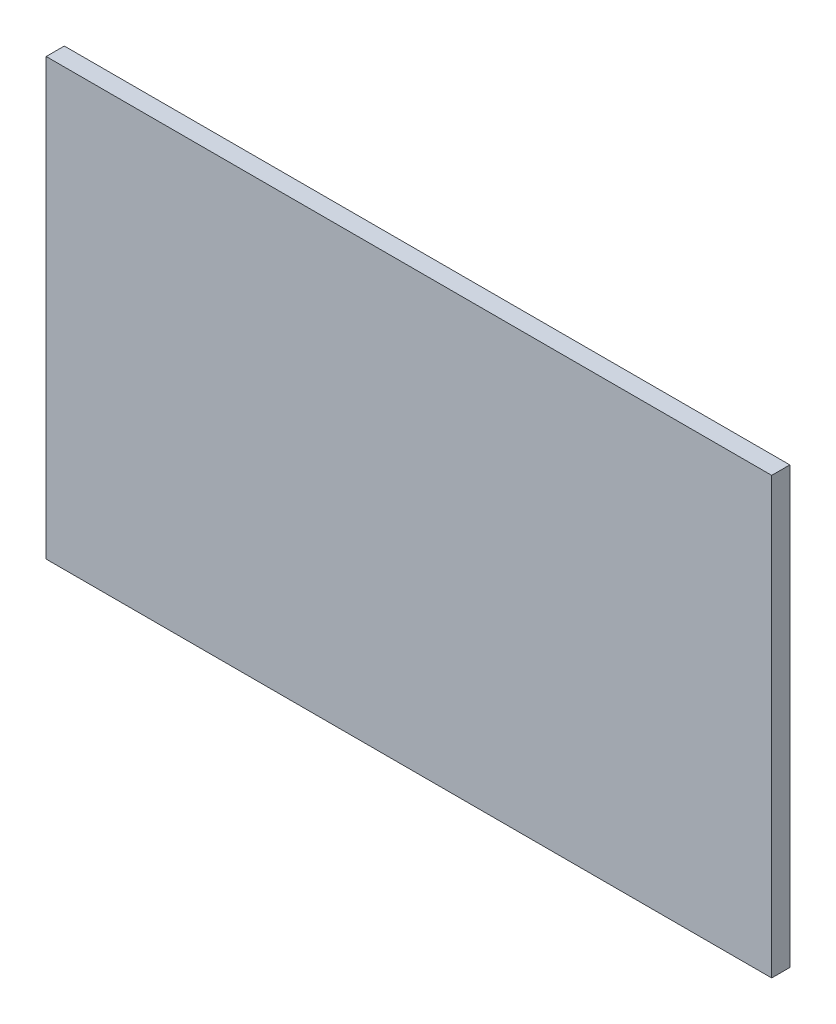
ISO-10303-21;
HEADER;
FILE_DESCRIPTION(('STEP AP214'),'2;1');
FILE_NAME('part.step','',(''),(''),'','','');
FILE_SCHEMA(('AUTOMOTIVE_DESIGN { 1 0 10303 214 1 1 1 1 }'));
ENDSEC;
DATA;
#1=APPLICATION_CONTEXT('core data for automotive mechanical design processes');
#2=APPLICATION_PROTOCOL_DEFINITION('international standard','automotive_design',2000,#1);
#3=PRODUCT_CONTEXT('',#1,'mechanical');
#4=PRODUCT('Part','Part','',(#3));
#5=PRODUCT_RELATED_PRODUCT_CATEGORY('part','',(#4));
#6=PRODUCT_DEFINITION_FORMATION('','',#4);
#7=PRODUCT_DEFINITION_CONTEXT('part definition',#1,'design');
#8=PRODUCT_DEFINITION('design','',#6,#7);
#9=PRODUCT_DEFINITION_SHAPE('','',#8);
#10=(LENGTH_UNIT() NAMED_UNIT(*) SI_UNIT(.MILLI.,.METRE.));
#11=(NAMED_UNIT(*) PLANE_ANGLE_UNIT() SI_UNIT($,.RADIAN.));
#12=(NAMED_UNIT(*) SI_UNIT($,.STERADIAN.) SOLID_ANGLE_UNIT());
#13=UNCERTAINTY_MEASURE_WITH_UNIT(LENGTH_MEASURE(1.E-05),#10,'distance_accuracy_value','');
#14=(GEOMETRIC_REPRESENTATION_CONTEXT(3) GLOBAL_UNCERTAINTY_ASSIGNED_CONTEXT((#13)) GLOBAL_UNIT_ASSIGNED_CONTEXT((#10,
#11,#12)) REPRESENTATION_CONTEXT('',''));
#15=CARTESIAN_POINT('',(0.,0.,0.));
#16=DIRECTION('',(0.,0.,1.));
#17=DIRECTION('',(1.,0.,0.));
#18=AXIS2_PLACEMENT_3D('',#15,#16,#17);
#19=CARTESIAN_POINT('',(127.,-76.2,6.35));
#20=DIRECTION('',(-1.,0.,0.));
#21=DIRECTION('',(0.,0.,1.));
#22=AXIS2_PLACEMENT_3D('',#19,#20,#21);
#23=PLANE('',#22);
#24=DIRECTION('',(0.,1.,0.));
#25=VECTOR('',#24,1.);
#26=CARTESIAN_POINT('',(127.,-76.2,0.));
#27=LINE('',#26,#25);
#28=CARTESIAN_POINT('',(127.,-76.2,0.));
#29=VERTEX_POINT('',#28);
#30=CARTESIAN_POINT('',(127.,76.2,0.));
#31=VERTEX_POINT('',#30);
#32=EDGE_CURVE('E96',#29,#31,#27,.T.);
#33=ORIENTED_EDGE('',*,*,#32,.T.);
#34=DIRECTION('',(0.,0.,-1.));
#35=VECTOR('',#34,1.);
#36=CARTESIAN_POINT('',(127.,76.2,6.35));
#37=LINE('',#36,#35);
#38=CARTESIAN_POINT('',(127.,76.2,6.35));
#39=VERTEX_POINT('',#38);
#40=EDGE_CURVE('E11',#39,#31,#37,.T.);
#41=ORIENTED_EDGE('',*,*,#40,.F.);
#42=DIRECTION('',(0.,1.,0.));
#43=VECTOR('',#42,1.);
#44=CARTESIAN_POINT('',(127.,-76.2,6.35));
#45=LINE('',#44,#43);
#46=CARTESIAN_POINT('',(127.,-76.2,6.35));
#47=VERTEX_POINT('',#46);
#48=EDGE_CURVE('E84',#47,#39,#45,.T.);
#49=ORIENTED_EDGE('',*,*,#48,.F.);
#50=DIRECTION('',(0.,0.,-1.));
#51=VECTOR('',#50,1.);
#52=CARTESIAN_POINT('',(127.,-76.2,6.35));
#53=LINE('',#52,#51);
#54=EDGE_CURVE('E92',#47,#29,#53,.T.);
#55=ORIENTED_EDGE('',*,*,#54,.T.);
#56=EDGE_LOOP('',(#33,#41,#49,#55));
#57=FACE_BOUND('',#56,.T.);
#58=ADVANCED_FACE('F33',(#57),#23,.F.);
#59=CARTESIAN_POINT('',(-127.,76.2,6.35));
#60=DIRECTION('',(0.,-1.,0.));
#61=DIRECTION('',(0.,0.,-1.));
#62=AXIS2_PLACEMENT_3D('',#59,#60,#61);
#63=PLANE('',#62);
#64=DIRECTION('',(-1.,0.,0.));
#65=VECTOR('',#64,1.);
#66=CARTESIAN_POINT('',(-127.,76.2,0.));
#67=LINE('',#66,#65);
#68=CARTESIAN_POINT('',(-127.,76.2,0.));
#69=VERTEX_POINT('',#68);
#70=EDGE_CURVE('E88',#31,#69,#67,.T.);
#71=ORIENTED_EDGE('',*,*,#70,.T.);
#72=DIRECTION('',(0.,0.,-1.));
#73=VECTOR('',#72,1.);
#74=CARTESIAN_POINT('',(-127.,76.2,6.35));
#75=LINE('',#74,#73);
#76=CARTESIAN_POINT('',(-127.,76.2,6.35));
#77=VERTEX_POINT('',#76);
#78=EDGE_CURVE('E41',#77,#69,#75,.T.);
#79=ORIENTED_EDGE('',*,*,#78,.F.);
#80=DIRECTION('',(-1.,0.,0.));
#81=VECTOR('',#80,1.);
#82=CARTESIAN_POINT('',(-127.,76.2,6.35));
#83=LINE('',#82,#81);
#84=EDGE_CURVE('E79',#39,#77,#83,.T.);
#85=ORIENTED_EDGE('',*,*,#84,.F.);
#86=ORIENTED_EDGE('',*,*,#40,.T.);
#87=EDGE_LOOP('',(#71,#79,#85,#86));
#88=FACE_BOUND('',#87,.T.);
#89=ADVANCED_FACE('F87',(#88),#63,.F.);
#90=CARTESIAN_POINT('',(-127.,-76.2,6.35));
#91=DIRECTION('',(1.,0.,0.));
#92=DIRECTION('',(0.,0.,-1.));
#93=AXIS2_PLACEMENT_3D('',#90,#91,#92);
#94=PLANE('',#93);
#95=DIRECTION('',(0.,-1.,0.));
#96=VECTOR('',#95,1.);
#97=CARTESIAN_POINT('',(-127.,-76.2,0.));
#98=LINE('',#97,#96);
#99=CARTESIAN_POINT('',(-127.,-76.2,0.));
#100=VERTEX_POINT('',#99);
#101=EDGE_CURVE('E66',#69,#100,#98,.T.);
#102=ORIENTED_EDGE('',*,*,#101,.T.);
#103=DIRECTION('',(0.,0.,-1.));
#104=VECTOR('',#103,1.);
#105=CARTESIAN_POINT('',(-127.,-76.2,6.35));
#106=LINE('',#105,#104);
#107=CARTESIAN_POINT('',(-127.,-76.2,6.35));
#108=VERTEX_POINT('',#107);
#109=EDGE_CURVE('E89',#108,#100,#106,.T.);
#110=ORIENTED_EDGE('',*,*,#109,.F.);
#111=DIRECTION('',(0.,-1.,0.));
#112=VECTOR('',#111,1.);
#113=CARTESIAN_POINT('',(-127.,-76.2,6.35));
#114=LINE('',#113,#112);
#115=EDGE_CURVE('E82',#77,#108,#114,.T.);
#116=ORIENTED_EDGE('',*,*,#115,.F.);
#117=ORIENTED_EDGE('',*,*,#78,.T.);
#118=EDGE_LOOP('',(#102,#110,#116,#117));
#119=FACE_BOUND('',#118,.T.);
#120=ADVANCED_FACE('F90',(#119),#94,.F.);
#121=CARTESIAN_POINT('',(-127.,-76.2,6.35));
#122=DIRECTION('',(0.,1.,0.));
#123=DIRECTION('',(0.,0.,1.));
#124=AXIS2_PLACEMENT_3D('',#121,#122,#123);
#125=PLANE('',#124);
#126=DIRECTION('',(1.,0.,0.));
#127=VECTOR('',#126,1.);
#128=CARTESIAN_POINT('',(-127.,-76.2,0.));
#129=LINE('',#128,#127);
#130=EDGE_CURVE('E72',#100,#29,#129,.T.);
#131=ORIENTED_EDGE('',*,*,#130,.T.);
#132=ORIENTED_EDGE('',*,*,#54,.F.);
#133=DIRECTION('',(1.,0.,0.));
#134=VECTOR('',#133,1.);
#135=CARTESIAN_POINT('',(-127.,-76.2,6.35));
#136=LINE('',#135,#134);
#137=EDGE_CURVE('E49',#108,#47,#136,.T.);
#138=ORIENTED_EDGE('',*,*,#137,.F.);
#139=ORIENTED_EDGE('',*,*,#109,.T.);
#140=EDGE_LOOP('',(#131,#132,#138,#139));
#141=FACE_BOUND('',#140,.T.);
#142=ADVANCED_FACE('F103',(#141),#125,.F.);
#143=CARTESIAN_POINT('',(0.,0.,6.35));
#144=DIRECTION('',(0.,0.,-1.));
#145=DIRECTION('',(-1.,0.,0.));
#146=AXIS2_PLACEMENT_3D('',#143,#144,#145);
#147=PLANE('',#146);
#148=ORIENTED_EDGE('',*,*,#48,.T.);
#149=ORIENTED_EDGE('',*,*,#84,.T.);
#150=ORIENTED_EDGE('',*,*,#115,.T.);
#151=ORIENTED_EDGE('',*,*,#137,.T.);
#152=EDGE_LOOP('',(#148,#149,#150,#151));
#153=FACE_BOUND('',#152,.T.);
#154=ADVANCED_FACE('F80',(#153),#147,.F.);
#155=CARTESIAN_POINT('',(0.,0.,0.));
#156=DIRECTION('',(0.,0.,-1.));
#157=DIRECTION('',(-1.,0.,0.));
#158=AXIS2_PLACEMENT_3D('',#155,#156,#157);
#159=PLANE('',#158);
#160=ORIENTED_EDGE('',*,*,#32,.F.);
#161=ORIENTED_EDGE('',*,*,#130,.F.);
#162=ORIENTED_EDGE('',*,*,#101,.F.);
#163=ORIENTED_EDGE('',*,*,#70,.F.);
#164=EDGE_LOOP('',(#160,#161,#162,#163));
#165=FACE_BOUND('',#164,.T.);
#166=ADVANCED_FACE('F106',(#165),#159,.T.);
#167=CLOSED_SHELL('',(#58,#89,#120,#142,#154,#166));
#168=MANIFOLD_SOLID_BREP('B2',#167);
#169=ADVANCED_BREP_SHAPE_REPRESENTATION('',(#18,#168),#14);
#170=SHAPE_DEFINITION_REPRESENTATION(#9,#169);
ENDSEC;
END-ISO-10303-21;
